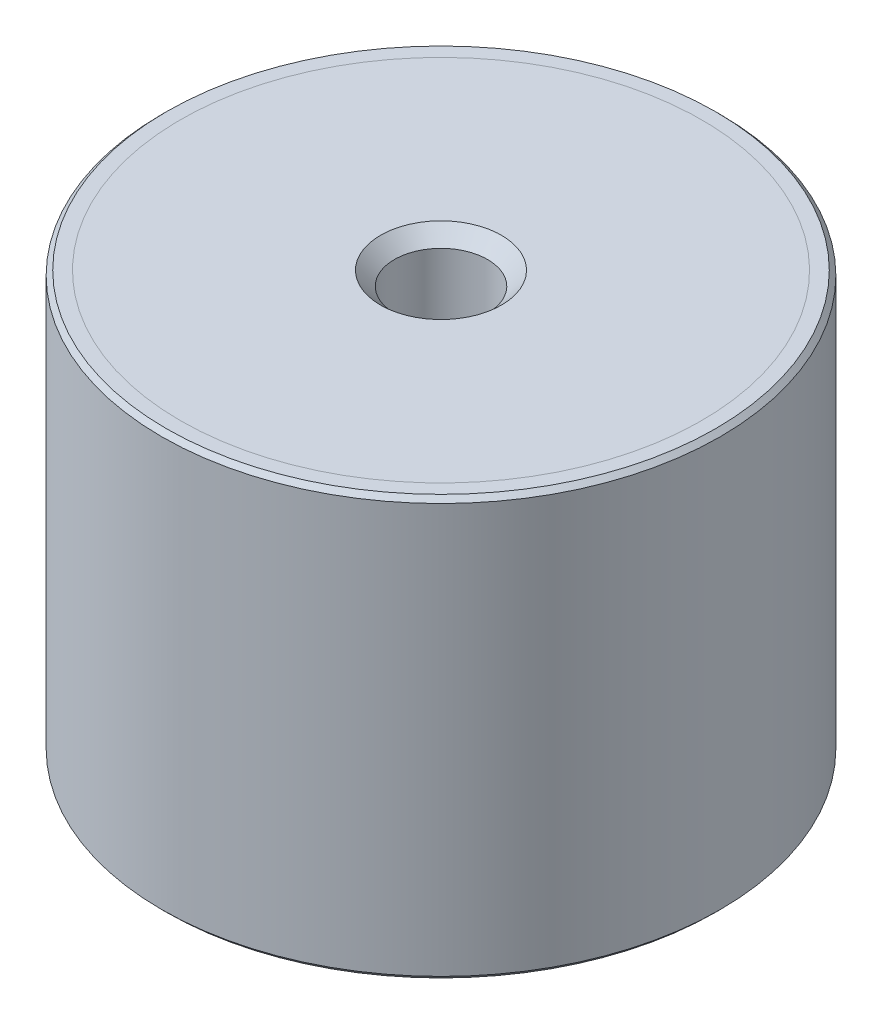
ISO-10303-21;
HEADER;
FILE_DESCRIPTION(('STEP AP214'),'2;1');
FILE_NAME('part.step','',(''),(''),'','','');
FILE_SCHEMA(('AUTOMOTIVE_DESIGN { 1 0 10303 214 1 1 1 1 }'));
ENDSEC;
DATA;
#1=APPLICATION_CONTEXT('core data for automotive mechanical design processes');
#2=APPLICATION_PROTOCOL_DEFINITION('international standard','automotive_design',2000,#1);
#3=PRODUCT_CONTEXT('',#1,'mechanical');
#4=PRODUCT('Part','Part','',(#3));
#5=PRODUCT_RELATED_PRODUCT_CATEGORY('part','',(#4));
#6=PRODUCT_DEFINITION_FORMATION('','',#4);
#7=PRODUCT_DEFINITION_CONTEXT('part definition',#1,'design');
#8=PRODUCT_DEFINITION('design','',#6,#7);
#9=PRODUCT_DEFINITION_SHAPE('','',#8);
#10=(LENGTH_UNIT() NAMED_UNIT(*) SI_UNIT(.MILLI.,.METRE.));
#11=(NAMED_UNIT(*) PLANE_ANGLE_UNIT() SI_UNIT($,.RADIAN.));
#12=(NAMED_UNIT(*) SI_UNIT($,.STERADIAN.) SOLID_ANGLE_UNIT());
#13=UNCERTAINTY_MEASURE_WITH_UNIT(LENGTH_MEASURE(1.E-05),#10,'distance_accuracy_value','');
#14=(GEOMETRIC_REPRESENTATION_CONTEXT(3) GLOBAL_UNCERTAINTY_ASSIGNED_CONTEXT((#13)) GLOBAL_UNIT_ASSIGNED_CONTEXT((#10,
#11,#12)) REPRESENTATION_CONTEXT('',''));
#15=CARTESIAN_POINT('',(0.,0.,0.));
#16=DIRECTION('',(0.,0.,1.));
#17=DIRECTION('',(1.,0.,0.));
#18=AXIS2_PLACEMENT_3D('',#15,#16,#17);
#19=CARTESIAN_POINT('',(0.,-42.,5.));
#20=DIRECTION('',(0.,1.,0.));
#21=DIRECTION('',(0.,0.,1.));
#22=AXIS2_PLACEMENT_3D('',#19,#20,#21);
#23=PLANE('',#22);
#24=CARTESIAN_POINT('',(0.,-42.,0.));
#25=DIRECTION('',(0.,1.,0.));
#26=DIRECTION('',(0.,0.,1.));
#27=AXIS2_PLACEMENT_3D('',#24,#25,#26);
#28=CIRCLE('',#27,28.);
#29=CARTESIAN_POINT('',(0.,-42.,28.));
#30=VERTEX_POINT('',#29);
#31=EDGE_CURVE('P0_E25',#30,#30,#28,.T.);
#32=ORIENTED_EDGE('',*,*,#31,.T.);
#33=EDGE_LOOP('',(#32));
#34=FACE_BOUND('',#33,.T.);
#35=CARTESIAN_POINT('',(0.,-42.,0.));
#36=DIRECTION('',(0.,1.,0.));
#37=DIRECTION('',(0.,0.,1.));
#38=AXIS2_PLACEMENT_3D('',#35,#36,#37);
#39=CIRCLE('',#38,5.);
#40=CARTESIAN_POINT('',(0.,-42.,5.));
#41=VERTEX_POINT('',#40);
#42=EDGE_CURVE('P0_E21',#41,#41,#39,.T.);
#43=ORIENTED_EDGE('',*,*,#42,.F.);
#44=EDGE_LOOP('',(#43));
#45=FACE_BOUND('',#44,.T.);
#46=ADVANCED_FACE('P0_F14',(#34,#45),#23,.T.);
#47=CARTESIAN_POINT('',(0.,26.0340428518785,0.));
#48=DIRECTION('',(0.,1.,0.));
#49=DIRECTION('',(0.,0.,1.));
#50=AXIS2_PLACEMENT_3D('',#47,#48,#49);
#51=CYLINDRICAL_SURFACE('',#50,28.);
#52=CARTESIAN_POINT('',(0.,-43.5,0.));
#53=DIRECTION('',(0.,1.,0.));
#54=DIRECTION('',(0.,0.,1.));
#55=AXIS2_PLACEMENT_3D('',#52,#53,#54);
#56=CIRCLE('',#55,28.);
#57=CARTESIAN_POINT('',(0.,-43.5,28.));
#58=VERTEX_POINT('',#57);
#59=EDGE_CURVE('P0_E29',#58,#58,#56,.T.);
#60=ORIENTED_EDGE('',*,*,#59,.T.);
#61=EDGE_LOOP('',(#60));
#62=FACE_BOUND('',#61,.T.);
#63=ORIENTED_EDGE('',*,*,#31,.F.);
#64=EDGE_LOOP('',(#63));
#65=FACE_BOUND('',#64,.T.);
#66=ADVANCED_FACE('P0_F35',(#62,#65),#51,.T.);
#67=CARTESIAN_POINT('',(0.,-43.5,28.));
#68=DIRECTION('',(0.,-1.,0.));
#69=DIRECTION('',(0.,0.,-1.));
#70=AXIS2_PLACEMENT_3D('',#67,#68,#69);
#71=PLANE('',#70);
#72=CARTESIAN_POINT('',(0.,-43.5,0.));
#73=DIRECTION('',(0.,-1.,0.));
#74=DIRECTION('',(0.,0.,-1.));
#75=AXIS2_PLACEMENT_3D('',#72,#73,#74);
#76=CIRCLE('',#75,6.49999999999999);
#77=CARTESIAN_POINT('',(0.,-43.5,-6.49999999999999));
#78=VERTEX_POINT('',#77);
#79=EDGE_CURVE('P0_E10',#78,#78,#76,.F.);
#80=ORIENTED_EDGE('',*,*,#79,.T.);
#81=EDGE_LOOP('',(#80));
#82=FACE_BOUND('',#81,.T.);
#83=ORIENTED_EDGE('',*,*,#59,.F.);
#84=EDGE_LOOP('',(#83));
#85=FACE_BOUND('',#84,.T.);
#86=ADVANCED_FACE('P0_F38',(#82,#85),#71,.T.);
#87=CARTESIAN_POINT('',(0.,-43.5,0.));
#88=DIRECTION('',(0.,-1.,0.));
#89=DIRECTION('',(0.,0.,-1.));
#90=AXIS2_PLACEMENT_3D('',#87,#88,#89);
#91=CONICAL_SURFACE('',#90,6.49999999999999,0.785398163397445);
#92=ORIENTED_EDGE('',*,*,#42,.T.);
#93=EDGE_LOOP('',(#92));
#94=FACE_BOUND('',#93,.T.);
#95=ORIENTED_EDGE('',*,*,#79,.F.);
#96=EDGE_LOOP('',(#95));
#97=FACE_BOUND('',#96,.T.);
#98=ADVANCED_FACE('P0_F16',(#94,#97),#91,.F.);
#99=CLOSED_SHELL('',(#46,#66,#86,#98));
#100=MANIFOLD_SOLID_BREP('P0_B1',#99);
#101=CARTESIAN_POINT('',(0.,1.5,5.));
#102=DIRECTION('',(0.,1.,0.));
#103=DIRECTION('',(0.,0.,1.));
#104=AXIS2_PLACEMENT_3D('',#101,#102,#103);
#105=PLANE('',#104);
#106=CARTESIAN_POINT('',(0.,1.5,0.));
#107=DIRECTION('',(0.,1.,0.));
#108=DIRECTION('',(0.,0.,1.));
#109=AXIS2_PLACEMENT_3D('',#106,#107,#108);
#110=CIRCLE('',#109,6.49999999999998);
#111=CARTESIAN_POINT('',(0.,1.5,6.49999999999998));
#112=VERTEX_POINT('',#111);
#113=EDGE_CURVE('P1_E10',#112,#112,#110,.F.);
#114=ORIENTED_EDGE('',*,*,#113,.T.);
#115=EDGE_LOOP('',(#114));
#116=FACE_BOUND('',#115,.T.);
#117=CARTESIAN_POINT('',(0.,1.5,0.));
#118=DIRECTION('',(0.,1.,0.));
#119=DIRECTION('',(0.,0.,1.));
#120=AXIS2_PLACEMENT_3D('',#117,#118,#119);
#121=CIRCLE('',#120,28.);
#122=CARTESIAN_POINT('',(0.,1.5,28.));
#123=VERTEX_POINT('',#122);
#124=EDGE_CURVE('P1_E21',#123,#123,#121,.T.);
#125=ORIENTED_EDGE('',*,*,#124,.T.);
#126=EDGE_LOOP('',(#125));
#127=FACE_BOUND('',#126,.T.);
#128=ADVANCED_FACE('P1_F14',(#116,#127),#105,.T.);
#129=CARTESIAN_POINT('',(0.,69.5340428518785,0.));
#130=DIRECTION('',(0.,1.,0.));
#131=DIRECTION('',(0.,0.,1.));
#132=AXIS2_PLACEMENT_3D('',#129,#130,#131);
#133=CYLINDRICAL_SURFACE('',#132,28.);
#134=CARTESIAN_POINT('',(0.,0.,0.));
#135=DIRECTION('',(0.,1.,0.));
#136=DIRECTION('',(0.,0.,1.));
#137=AXIS2_PLACEMENT_3D('',#134,#135,#136);
#138=CIRCLE('',#137,28.);
#139=CARTESIAN_POINT('',(0.,0.,28.));
#140=VERTEX_POINT('',#139);
#141=EDGE_CURVE('P1_E25',#140,#140,#138,.T.);
#142=ORIENTED_EDGE('',*,*,#141,.T.);
#143=EDGE_LOOP('',(#142));
#144=FACE_BOUND('',#143,.T.);
#145=ORIENTED_EDGE('',*,*,#124,.F.);
#146=EDGE_LOOP('',(#145));
#147=FACE_BOUND('',#146,.T.);
#148=ADVANCED_FACE('P1_F44',(#144,#147),#133,.T.);
#149=CARTESIAN_POINT('',(0.,0.,28.));
#150=DIRECTION('',(0.,-1.,0.));
#151=DIRECTION('',(0.,0.,-1.));
#152=AXIS2_PLACEMENT_3D('',#149,#150,#151);
#153=PLANE('',#152);
#154=CARTESIAN_POINT('',(0.,0.,0.));
#155=DIRECTION('',(0.,1.,0.));
#156=DIRECTION('',(0.,0.,1.));
#157=AXIS2_PLACEMENT_3D('',#154,#155,#156);
#158=CIRCLE('',#157,5.);
#159=CARTESIAN_POINT('',(0.,0.,4.99999999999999));
#160=VERTEX_POINT('',#159);
#161=EDGE_CURVE('P1_E29',#160,#160,#158,.T.);
#162=ORIENTED_EDGE('',*,*,#161,.T.);
#163=EDGE_LOOP('',(#162));
#164=FACE_BOUND('',#163,.T.);
#165=ORIENTED_EDGE('',*,*,#141,.F.);
#166=EDGE_LOOP('',(#165));
#167=FACE_BOUND('',#166,.T.);
#168=ADVANCED_FACE('P1_F35',(#164,#167),#153,.T.);
#169=CARTESIAN_POINT('',(0.,0.,0.));
#170=DIRECTION('',(0.,1.,0.));
#171=DIRECTION('',(0.,0.,1.));
#172=AXIS2_PLACEMENT_3D('',#169,#170,#171);
#173=CONICAL_SURFACE('',#172,5.,0.785398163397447);
#174=CARTESIAN_POINT('',(0.,1.5,6.49999999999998));
#175=CARTESIAN_POINT('',(0.,1.484375,6.48437499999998));
#176=CARTESIAN_POINT('',(0.,1.46875,6.46874999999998));
#177=CARTESIAN_POINT('',(0.,1.4375,6.43749999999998));
#178=CARTESIAN_POINT('',(0.,1.421875,6.42187499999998));
#179=CARTESIAN_POINT('',(0.,1.390625,6.39062499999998));
#180=CARTESIAN_POINT('',(0.,1.375,6.37499999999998));
#181=CARTESIAN_POINT('',(0.,1.34375,6.34374999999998));
#182=CARTESIAN_POINT('',(0.,1.328125,6.32812499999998));
#183=CARTESIAN_POINT('',(0.,1.296875,6.29687499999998));
#184=CARTESIAN_POINT('',(0.,1.28125,6.28124999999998));
#185=CARTESIAN_POINT('',(0.,1.25,6.24999999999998));
#186=CARTESIAN_POINT('',(0.,1.234375,6.23437499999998));
#187=CARTESIAN_POINT('',(0.,1.203125,6.20312499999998));
#188=CARTESIAN_POINT('',(0.,1.1875,6.18749999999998));
#189=CARTESIAN_POINT('',(0.,1.15625,6.15624999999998));
#190=CARTESIAN_POINT('',(0.,1.140625,6.14062499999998));
#191=CARTESIAN_POINT('',(0.,1.109375,6.10937499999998));
#192=CARTESIAN_POINT('',(0.,1.09375,6.09374999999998));
#193=CARTESIAN_POINT('',(0.,1.0625,6.06249999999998));
#194=CARTESIAN_POINT('',(0.,1.046875,6.04687499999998));
#195=CARTESIAN_POINT('',(0.,1.015625,6.01562499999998));
#196=CARTESIAN_POINT('',(0.,0.999999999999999,5.99999999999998));
#197=CARTESIAN_POINT('',(0.,0.968749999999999,5.96874999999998));
#198=CARTESIAN_POINT('',(0.,0.953124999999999,5.95312499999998));
#199=CARTESIAN_POINT('',(0.,0.921874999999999,5.92187499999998));
#200=CARTESIAN_POINT('',(0.,0.906249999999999,5.90624999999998));
#201=CARTESIAN_POINT('',(0.,0.874999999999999,5.87499999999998));
#202=CARTESIAN_POINT('',(0.,0.859374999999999,5.85937499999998));
#203=CARTESIAN_POINT('',(0.,0.828124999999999,5.82812499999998));
#204=CARTESIAN_POINT('',(0.,0.812499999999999,5.81249999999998));
#205=CARTESIAN_POINT('',(0.,0.781249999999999,5.78124999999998));
#206=CARTESIAN_POINT('',(0.,0.765624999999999,5.76562499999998));
#207=CARTESIAN_POINT('',(0.,0.734374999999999,5.73437499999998));
#208=CARTESIAN_POINT('',(0.,0.718749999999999,5.71874999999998));
#209=CARTESIAN_POINT('',(0.,0.687499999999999,5.68749999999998));
#210=CARTESIAN_POINT('',(0.,0.671874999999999,5.67187499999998));
#211=CARTESIAN_POINT('',(0.,0.640624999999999,5.64062499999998));
#212=CARTESIAN_POINT('',(0.,0.624999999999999,5.62499999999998));
#213=CARTESIAN_POINT('',(0.,0.593749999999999,5.59374999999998));
#214=CARTESIAN_POINT('',(0.,0.578124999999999,5.57812499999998));
#215=CARTESIAN_POINT('',(0.,0.546874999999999,5.54687499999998));
#216=CARTESIAN_POINT('',(0.,0.531249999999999,5.53124999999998));
#217=CARTESIAN_POINT('',(0.,0.499999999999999,5.49999999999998));
#218=CARTESIAN_POINT('',(0.,0.484374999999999,5.48437499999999));
#219=CARTESIAN_POINT('',(0.,0.453124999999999,5.45312499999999));
#220=CARTESIAN_POINT('',(0.,0.437499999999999,5.43749999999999));
#221=CARTESIAN_POINT('',(0.,0.406249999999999,5.40624999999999));
#222=CARTESIAN_POINT('',(0.,0.390624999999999,5.39062499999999));
#223=CARTESIAN_POINT('',(0.,0.359374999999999,5.35937499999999));
#224=CARTESIAN_POINT('',(0.,0.343749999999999,5.34374999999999));
#225=CARTESIAN_POINT('',(0.,0.312499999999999,5.31249999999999));
#226=CARTESIAN_POINT('',(0.,0.296874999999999,5.29687499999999));
#227=CARTESIAN_POINT('',(0.,0.265624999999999,5.26562499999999));
#228=CARTESIAN_POINT('',(0.,0.249999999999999,5.24999999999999));
#229=CARTESIAN_POINT('',(0.,0.218749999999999,5.21874999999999));
#230=CARTESIAN_POINT('',(0.,0.203124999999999,5.20312499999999));
#231=CARTESIAN_POINT('',(0.,0.171874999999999,5.17187499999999));
#232=CARTESIAN_POINT('',(0.,0.156249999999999,5.15624999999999));
#233=CARTESIAN_POINT('',(0.,0.124999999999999,5.12499999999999));
#234=CARTESIAN_POINT('',(0.,0.109374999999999,5.10937499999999));
#235=CARTESIAN_POINT('',(0.,0.0781249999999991,5.07812499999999));
#236=CARTESIAN_POINT('',(0.,0.0624999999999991,5.06249999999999));
#237=CARTESIAN_POINT('',(0.,0.0312499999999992,5.03124999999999));
#238=CARTESIAN_POINT('',(0.,0.0156249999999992,5.01562499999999));
#239=CARTESIAN_POINT('',(0.,0.,4.99999999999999));
#240=B_SPLINE_CURVE_WITH_KNOTS('',3,(#174,#175,#176,#177,#178,#179,#180,#181,#182,#183,#184,
#185,#186,#187,#188,#189,#190,#191,#192,#193,#194,#195,#196,#197,#198,#199,#200,#201,#202,#203,
#204,#205,#206,#207,#208,#209,#210,#211,#212,#213,#214,#215,#216,#217,#218,#219,#220,#221,#222,
#223,#224,#225,#226,#227,#228,#229,#230,#231,#232,#233,#234,#235,#236,#237,#238,#239),
.UNSPECIFIED.,.F.,.F.,(4,2,2,2,2,2,2,2,2,2,2,2,2,2,2,2,2,2,2,2,2,2,2,2,2,2,2,2,2,2,2,2,4),(0.,
0.0662912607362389,0.132582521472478,0.198873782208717,0.265165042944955,0.331456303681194,
0.397747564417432,0.464038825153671,0.53033008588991,0.596621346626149,0.662912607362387,
0.729203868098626,0.795495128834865,0.861786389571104,0.928077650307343,0.994368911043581,
1.06066017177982,1.12695143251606,1.1932426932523,1.25953395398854,1.32582521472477,
1.39211647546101,1.45840773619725,1.52469899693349,1.59099025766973,1.65728151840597,
1.72357277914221,1.78986403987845,1.85615530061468,1.92244656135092,1.98873782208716,
2.0550290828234,2.12132034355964),.UNSPECIFIED.);
#241=EDGE_CURVE('P1_BSEAM16',#112,#160,#240,.T.);
#242=ORIENTED_EDGE('',*,*,#113,.F.);
#243=ORIENTED_EDGE('',*,*,#161,.F.);
#244=ORIENTED_EDGE('',*,*,#241,.T.);
#245=ORIENTED_EDGE('',*,*,#241,.F.);
#246=EDGE_LOOP('',(#242,#244,#243,#245));
#247=FACE_BOUND('',#246,.T.);
#248=ADVANCED_FACE('P1_F16',(#247),#173,.F.);
#249=CLOSED_SHELL('',(#128,#148,#168,#248));
#250=MANIFOLD_SOLID_BREP('P1_B1',#249);
#251=CARTESIAN_POINT('',(0.,0.,0.));
#252=DIRECTION('',(0.,1.,0.));
#253=DIRECTION('',(0.,0.,1.));
#254=AXIS2_PLACEMENT_3D('',#251,#252,#253);
#255=PLANE('',#254);
#256=CARTESIAN_POINT('',(0.,0.,0.));
#257=DIRECTION('',(0.,1.,0.));
#258=DIRECTION('',(0.,0.,1.));
#259=AXIS2_PLACEMENT_3D('',#256,#257,#258);
#260=CIRCLE('',#259,5.);
#261=CARTESIAN_POINT('',(0.,0.,5.));
#262=VERTEX_POINT('',#261);
#263=EDGE_CURVE('P2_E46',#262,#262,#260,.T.);
#264=ORIENTED_EDGE('',*,*,#263,.F.);
#265=EDGE_LOOP('',(#264));
#266=FACE_BOUND('',#265,.T.);
#267=CARTESIAN_POINT('',(0.,0.,0.));
#268=DIRECTION('',(0.,1.,0.));
#269=DIRECTION('',(0.,0.,1.));
#270=AXIS2_PLACEMENT_3D('',#267,#268,#269);
#271=CIRCLE('',#270,28.);
#272=CARTESIAN_POINT('',(0.,0.,28.));
#273=VERTEX_POINT('',#272);
#274=EDGE_CURVE('P2_E33',#273,#273,#271,.T.);
#275=ORIENTED_EDGE('',*,*,#274,.T.);
#276=EDGE_LOOP('',(#275));
#277=FACE_BOUND('',#276,.T.);
#278=ADVANCED_FACE('P2_F13',(#266,#277),#255,.T.);
#279=CARTESIAN_POINT('',(0.,65.5134936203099,0.));
#280=DIRECTION('',(0.,1.,0.));
#281=DIRECTION('',(0.,0.,1.));
#282=AXIS2_PLACEMENT_3D('',#279,#280,#281);
#283=CYLINDRICAL_SURFACE('',#282,28.);
#284=CARTESIAN_POINT('',(0.,1.5,0.));
#285=DIRECTION('',(0.,1.,0.));
#286=DIRECTION('',(0.,0.,1.));
#287=AXIS2_PLACEMENT_3D('',#284,#285,#286);
#288=CIRCLE('',#287,28.);
#289=CARTESIAN_POINT('',(0.,1.5,28.));
#290=VERTEX_POINT('',#289);
#291=EDGE_CURVE('P2_E36',#290,#290,#288,.T.);
#292=ORIENTED_EDGE('',*,*,#291,.T.);
#293=EDGE_LOOP('',(#292));
#294=FACE_BOUND('',#293,.T.);
#295=ORIENTED_EDGE('',*,*,#274,.F.);
#296=EDGE_LOOP('',(#295));
#297=FACE_BOUND('',#296,.T.);
#298=ADVANCED_FACE('P2_F92',(#294,#297),#283,.F.);
#299=CARTESIAN_POINT('',(0.,1.5,28.));
#300=DIRECTION('',(0.,1.,0.));
#301=DIRECTION('',(0.,0.,1.));
#302=AXIS2_PLACEMENT_3D('',#299,#300,#301);
#303=PLANE('',#302);
#304=CARTESIAN_POINT('',(0.,1.5,0.));
#305=DIRECTION('',(0.,1.,0.));
#306=DIRECTION('',(0.,0.,1.));
#307=AXIS2_PLACEMENT_3D('',#304,#305,#306);
#308=CIRCLE('',#307,29.5);
#309=CARTESIAN_POINT('',(0.,1.5,29.5));
#310=VERTEX_POINT('',#309);
#311=EDGE_CURVE('P2_E9',#310,#310,#308,.T.);
#312=ORIENTED_EDGE('',*,*,#311,.T.);
#313=EDGE_LOOP('',(#312));
#314=FACE_BOUND('',#313,.T.);
#315=ORIENTED_EDGE('',*,*,#291,.F.);
#316=EDGE_LOOP('',(#315));
#317=FACE_BOUND('',#316,.T.);
#318=ADVANCED_FACE('P2_F88',(#314,#317),#303,.T.);
#319=CARTESIAN_POINT('',(0.,65.5134936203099,0.));
#320=DIRECTION('',(0.,1.,0.));
#321=DIRECTION('',(0.,0.,1.));
#322=AXIS2_PLACEMENT_3D('',#319,#320,#321);
#323=CYLINDRICAL_SURFACE('',#322,30.);
#324=CARTESIAN_POINT('',(0.,-43.,0.));
#325=DIRECTION('',(0.,-1.,0.));
#326=DIRECTION('',(0.,0.,-1.));
#327=AXIS2_PLACEMENT_3D('',#324,#325,#326);
#328=CIRCLE('',#327,30.);
#329=CARTESIAN_POINT('',(0.,-43.,-30.));
#330=VERTEX_POINT('',#329);
#331=EDGE_CURVE('P2_E24',#330,#330,#328,.F.);
#332=ORIENTED_EDGE('',*,*,#331,.T.);
#333=EDGE_LOOP('',(#332));
#334=FACE_BOUND('',#333,.T.);
#335=CARTESIAN_POINT('',(0.,0.999999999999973,0.));
#336=DIRECTION('',(0.,1.,0.));
#337=DIRECTION('',(0.,0.,1.));
#338=AXIS2_PLACEMENT_3D('',#335,#336,#337);
#339=CIRCLE('',#338,30.);
#340=CARTESIAN_POINT('',(0.,0.999999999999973,30.));
#341=VERTEX_POINT('',#340);
#342=EDGE_CURVE('P2_E28',#341,#341,#339,.F.);
#343=ORIENTED_EDGE('',*,*,#342,.T.);
#344=EDGE_LOOP('',(#343));
#345=FACE_BOUND('',#344,.T.);
#346=ADVANCED_FACE('P2_F82',(#334,#345),#323,.T.);
#347=CARTESIAN_POINT('',(0.,-43.5,30.));
#348=DIRECTION('',(0.,-1.,0.));
#349=DIRECTION('',(0.,0.,-1.));
#350=AXIS2_PLACEMENT_3D('',#347,#348,#349);
#351=PLANE('',#350);
#352=CARTESIAN_POINT('',(0.,-43.5,0.));
#353=DIRECTION('',(0.,-1.,0.));
#354=DIRECTION('',(0.,0.,-1.));
#355=AXIS2_PLACEMENT_3D('',#352,#353,#354);
#356=CIRCLE('',#355,29.5);
#357=CARTESIAN_POINT('',(0.,-43.5,-29.5));
#358=VERTEX_POINT('',#357);
#359=EDGE_CURVE('P2_E20',#358,#358,#356,.T.);
#360=ORIENTED_EDGE('',*,*,#359,.T.);
#361=EDGE_LOOP('',(#360));
#362=FACE_BOUND('',#361,.T.);
#363=CARTESIAN_POINT('',(0.,-43.5,0.));
#364=DIRECTION('',(0.,1.,0.));
#365=DIRECTION('',(0.,0.,1.));
#366=AXIS2_PLACEMENT_3D('',#363,#364,#365);
#367=CIRCLE('',#366,28.);
#368=CARTESIAN_POINT('',(0.,-43.5,28.));
#369=VERTEX_POINT('',#368);
#370=EDGE_CURVE('P2_E39',#369,#369,#367,.T.);
#371=ORIENTED_EDGE('',*,*,#370,.T.);
#372=EDGE_LOOP('',(#371));
#373=FACE_BOUND('',#372,.T.);
#374=ADVANCED_FACE('P2_F77',(#362,#373),#351,.T.);
#375=CARTESIAN_POINT('',(0.,65.5134936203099,0.));
#376=DIRECTION('',(0.,1.,0.));
#377=DIRECTION('',(0.,0.,1.));
#378=AXIS2_PLACEMENT_3D('',#375,#376,#377);
#379=CYLINDRICAL_SURFACE('',#378,28.);
#380=CARTESIAN_POINT('',(0.,-42.,0.));
#381=DIRECTION('',(0.,1.,0.));
#382=DIRECTION('',(0.,0.,1.));
#383=AXIS2_PLACEMENT_3D('',#380,#381,#382);
#384=CIRCLE('',#383,28.);
#385=CARTESIAN_POINT('',(0.,-42.,28.));
#386=VERTEX_POINT('',#385);
#387=EDGE_CURVE('P2_E42',#386,#386,#384,.T.);
#388=ORIENTED_EDGE('',*,*,#387,.T.);
#389=EDGE_LOOP('',(#388));
#390=FACE_BOUND('',#389,.T.);
#391=ORIENTED_EDGE('',*,*,#370,.F.);
#392=EDGE_LOOP('',(#391));
#393=FACE_BOUND('',#392,.T.);
#394=ADVANCED_FACE('P2_F71',(#390,#393),#379,.F.);
#395=CARTESIAN_POINT('',(0.,-42.,28.));
#396=DIRECTION('',(0.,-1.,0.));
#397=DIRECTION('',(0.,0.,-1.));
#398=AXIS2_PLACEMENT_3D('',#395,#396,#397);
#399=PLANE('',#398);
#400=CARTESIAN_POINT('',(0.,-42.,0.));
#401=DIRECTION('',(0.,-1.,0.));
#402=DIRECTION('',(0.,0.,-1.));
#403=AXIS2_PLACEMENT_3D('',#400,#401,#402);
#404=CIRCLE('',#403,5.);
#405=CARTESIAN_POINT('',(0.,-42.,-5.));
#406=VERTEX_POINT('',#405);
#407=EDGE_CURVE('P2_E52',#406,#406,#404,.T.);
#408=ORIENTED_EDGE('',*,*,#407,.F.);
#409=EDGE_LOOP('',(#408));
#410=FACE_BOUND('',#409,.T.);
#411=ORIENTED_EDGE('',*,*,#387,.F.);
#412=EDGE_LOOP('',(#411));
#413=FACE_BOUND('',#412,.T.);
#414=ADVANCED_FACE('P2_F67',(#410,#413),#399,.T.);
#415=CARTESIAN_POINT('',(0.,-43.,0.));
#416=DIRECTION('',(0.,1.,0.));
#417=DIRECTION('',(0.,0.,1.));
#418=AXIS2_PLACEMENT_3D('',#415,#416,#417);
#419=CONICAL_SURFACE('',#418,30.,0.785398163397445);
#420=ORIENTED_EDGE('',*,*,#359,.F.);
#421=EDGE_LOOP('',(#420));
#422=FACE_BOUND('',#421,.T.);
#423=ORIENTED_EDGE('',*,*,#331,.F.);
#424=EDGE_LOOP('',(#423));
#425=FACE_BOUND('',#424,.T.);
#426=ADVANCED_FACE('P2_F70',(#422,#425),#419,.T.);
#427=CARTESIAN_POINT('',(0.,1.5,0.));
#428=DIRECTION('',(0.,-1.,0.));
#429=DIRECTION('',(0.,0.,-1.));
#430=AXIS2_PLACEMENT_3D('',#427,#428,#429);
#431=CONICAL_SURFACE('',#430,29.5,0.785398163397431);
#432=ORIENTED_EDGE('',*,*,#342,.F.);
#433=EDGE_LOOP('',(#432));
#434=FACE_BOUND('',#433,.T.);
#435=ORIENTED_EDGE('',*,*,#311,.F.);
#436=EDGE_LOOP('',(#435));
#437=FACE_BOUND('',#436,.T.);
#438=ADVANCED_FACE('P2_F15',(#434,#437),#431,.T.);
#439=CARTESIAN_POINT('',(0.,-8.5,0.));
#440=DIRECTION('',(0.,1.,0.));
#441=DIRECTION('',(0.,0.,1.));
#442=AXIS2_PLACEMENT_3D('',#439,#440,#441);
#443=CYLINDRICAL_SURFACE('',#442,5.);
#444=CARTESIAN_POINT('',(0.,-8.5,0.));
#445=DIRECTION('',(0.,1.,0.));
#446=DIRECTION('',(0.,0.,1.));
#447=AXIS2_PLACEMENT_3D('',#444,#445,#446);
#448=CIRCLE('',#447,5.);
#449=CARTESIAN_POINT('',(0.,-8.5,5.));
#450=VERTEX_POINT('',#449);
#451=EDGE_CURVE('P2_E45',#450,#450,#448,.T.);
#452=ORIENTED_EDGE('',*,*,#451,.F.);
#453=EDGE_LOOP('',(#452));
#454=FACE_BOUND('',#453,.T.);
#455=ORIENTED_EDGE('',*,*,#263,.T.);
#456=EDGE_LOOP('',(#455));
#457=FACE_BOUND('',#456,.T.);
#458=ADVANCED_FACE('P2_F108',(#454,#457),#443,.F.);
#459=CARTESIAN_POINT('',(0.,-8.5,0.));
#460=DIRECTION('',(0.,1.,0.));
#461=DIRECTION('',(0.,0.,1.));
#462=AXIS2_PLACEMENT_3D('',#459,#460,#461);
#463=PLANE('',#462);
#464=ORIENTED_EDGE('',*,*,#451,.T.);
#465=EDGE_LOOP('',(#464));
#466=FACE_BOUND('',#465,.T.);
#467=ADVANCED_FACE('P2_F63',(#466),#463,.T.);
#468=CARTESIAN_POINT('',(0.,-33.5,0.));
#469=DIRECTION('',(0.,-1.,0.));
#470=DIRECTION('',(0.,0.,-1.));
#471=AXIS2_PLACEMENT_3D('',#468,#469,#470);
#472=CYLINDRICAL_SURFACE('',#471,5.);
#473=CARTESIAN_POINT('',(0.,-33.5,0.));
#474=DIRECTION('',(0.,-1.,0.));
#475=DIRECTION('',(0.,0.,-1.));
#476=AXIS2_PLACEMENT_3D('',#473,#474,#475);
#477=CIRCLE('',#476,5.);
#478=CARTESIAN_POINT('',(0.,-33.5,-5.));
#479=VERTEX_POINT('',#478);
#480=EDGE_CURVE('P2_E49',#479,#479,#477,.T.);
#481=ORIENTED_EDGE('',*,*,#480,.F.);
#482=EDGE_LOOP('',(#481));
#483=FACE_BOUND('',#482,.T.);
#484=ORIENTED_EDGE('',*,*,#407,.T.);
#485=EDGE_LOOP('',(#484));
#486=FACE_BOUND('',#485,.T.);
#487=ADVANCED_FACE('P2_F60',(#483,#486),#472,.F.);
#488=CARTESIAN_POINT('',(0.,-33.5,0.));
#489=DIRECTION('',(0.,-1.,0.));
#490=DIRECTION('',(0.,0.,-1.));
#491=AXIS2_PLACEMENT_3D('',#488,#489,#490);
#492=PLANE('',#491);
#493=ORIENTED_EDGE('',*,*,#480,.T.);
#494=EDGE_LOOP('',(#493));
#495=FACE_BOUND('',#494,.T.);
#496=ADVANCED_FACE('P2_F58',(#495),#492,.T.);
#497=CLOSED_SHELL('',(#278,#298,#318,#346,#374,#394,#414,#426,#438,#458,#467,#487,#496));
#498=MANIFOLD_SOLID_BREP('P2_B1',#497);
#499=ADVANCED_BREP_SHAPE_REPRESENTATION('',(#18,#100,#250,#498),#14);
#500=SHAPE_DEFINITION_REPRESENTATION(#9,#499);
ENDSEC;
END-ISO-10303-21;
